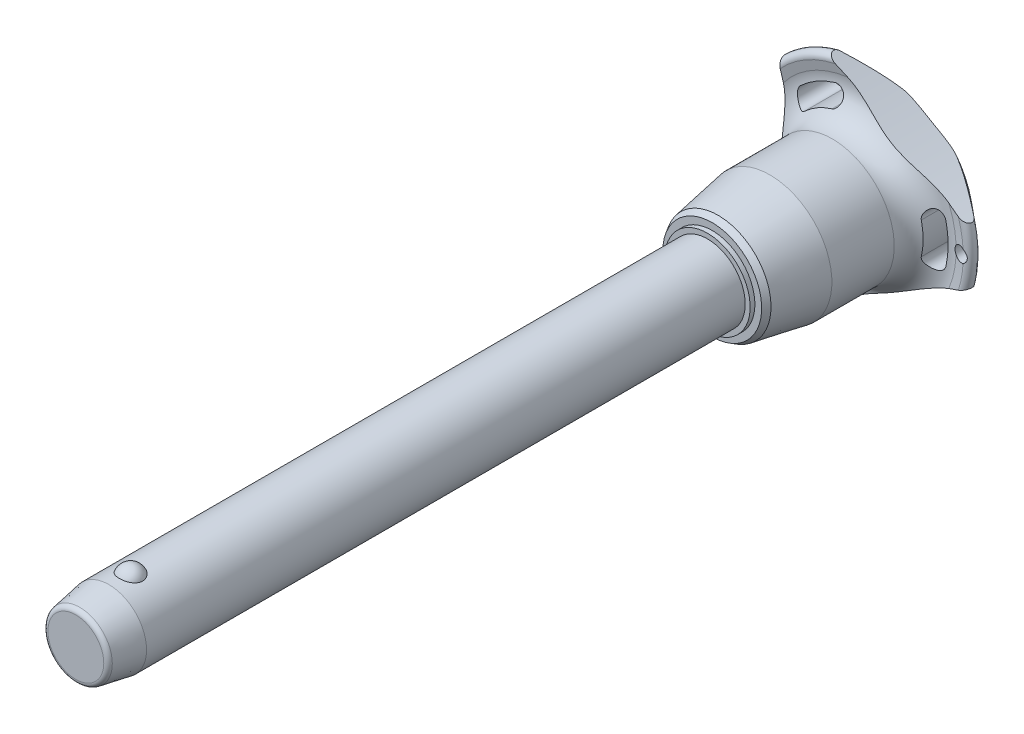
from build123d import *

# Parameters (mm, degrees)
SKETCH1_R           = 8
BOSS_EXTRUDE1_DEPTH = 120
SKETCH2_R           = 7
BOSS_EXTRUDE2_DEPTH = 39.7
BOSS_EXTRUDE3_START = 14
SKETCH1_2_R         = 8
BOSS_EXTRUDE3_DEPTH = 14
CHAMFER1_SIZE       = 7
CHAMFER1_SIZE2      = 1.234288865
FILLET1_R           = 1
SKETCH6_R           = 144.275
CUT_EXTRUDE1_DEPTH  = 164.211281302
CIRPATTERN1_COUNT   = 3
SKETCH7_R           = 1.5
CUT_EXTRUDE2_DEPTH  = 164.088271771


with BuildPart() as part:
    # Sketch1 → Boss-Extrude1 (new body)
    with BuildSketch(Plane.XY):
        Circle(SKETCH1_R)
    extrude(amount=-BOSS_EXTRUDE1_DEPTH)

    # Sketch2 → Boss-Extrude2 (add)
    with BuildSketch(Plane(origin=(0, 0, -120), x_dir=(-1, 0, 0), z_dir=(0, 0, -1))):
        Circle(SKETCH2_R)
    extrude(amount=BOSS_EXTRUDE2_DEPTH)

    # Sketch3 → Revolve1 (revolve)
    with BuildSketch(Plane(origin=(0, 0, 0), x_dir=(0, 0, -1), z_dir=(1, 0, 0))):
        with BuildLine():
            Line((-2.387467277, 9.5), (-2.387467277, 4.2))
            ThreePointArc((-2.387467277, 4.2), (0.262532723, 6.85), (-2.387467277, 9.5))
        make_face()
        with BuildLine():
            Line((-2.387467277, -4.2), (-2.387467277, -9.5))
            ThreePointArc((-2.387467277, -9.5), (0.262532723, -6.85), (-2.387467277, -4.2))
        make_face()
    revolve(axis=Axis((0, -4.2, 2.387467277), (0, 1, 0)))

    # Sketch1_2 → Boss-Extrude3 (add)
    with BuildSketch(Plane.XY.offset(BOSS_EXTRUDE3_START)):
        Circle(SKETCH1_2_R)
    extrude(amount=-BOSS_EXTRUDE3_DEPTH)

    # Chamfer1
    chamfer1_edges = [part.edges().sort_by_distance(p)[0] for p in [
        (-8, 0, 14),
    ]]
    chamfer1_side = [part.faces().sort_by_distance(p)[0] for p in [
        (-8, 0, -53),
    ]]
    chamfer(chamfer1_edges, length=CHAMFER1_SIZE, length2=CHAMFER1_SIZE2, reference=chamfer1_side[0])

    # Fillet1
    fillet1_edges = [part.edges().sort_by_distance(p)[0] for p in [
        (-6.765711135, 0, 14),
        (7, 0, -159.7),
    ]]
    fillet(fillet1_edges, radius=FILLET1_R)

    # Sketch4 → Revolve2 (revolve)
    with BuildSketch(Plane(origin=(0, 0, 0), x_dir=(0, 0, -1), z_dir=(1, 0, 0)), mode=Mode.PRIVATE) as revolve2_sk:
        Polygon((120, 0), (120, 9.044607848), (121, 9.044607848), (121, 10.490707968), (122.25235944, 11.213758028), (133.233333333, 13.15), (146.466666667, 13.15), (146.466666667, 0), align=None)
    revolve(revolve2_sk.sketch.rotate(Axis((0, 0, -146.466666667), (0, 0, 1)), 90), axis=Axis((0, 0, -146.466666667), (0, 0, 1)))

    # Sketch5 → Revolve3 (revolve)
    with BuildSketch(Plane(origin=(0, 0, 0), x_dir=(0, 0, -1), z_dir=(1, 0, 0)), mode=Mode.PRIVATE) as revolve3_sk:
        with BuildLine():
            Line((152.32877039, 20.428960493), (151.910912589, 22.344207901))
            ThreePointArc((151.910912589, 22.344207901), (152.554394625, 23.677136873), (154.002586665, 23.371345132))
            Line((154.002586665, 23.371345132), (159.141488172, 17.247040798))
            ThreePointArc((159.141488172, 17.247040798), (159.7, 15.584758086), (158.978803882, 13.986322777))
            ThreePointArc((158.978803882, 13.986322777), (154.617427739, 7.589034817), (153.083333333, 0))
            Line((153.083333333, 0), (146.466666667, 0))
            Line((146.466666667, 0), (146.466666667, 13.15))
            ThreePointArc((146.466666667, 13.15), (151.139661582, 15.38660811), (152.32877039, 20.428960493))
        make_face()
    revolve(revolve3_sk.sketch.rotate(Axis((0, 0, -153.083333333), (0, 0, 1)), 90), axis=Axis((0, 0, -153.083333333), (0, 0, 1)))

    # Sketch6 → Cut-Extrude1 (cut, through all)
    with BuildSketch(Plane.XY):
        with Locations((-159.975, 0)):
            Circle(SKETCH6_R)
        with BuildLine():
            ThreePointArc((18.131206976, -4.190753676), (18.60922037, 0), (18.131206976, 4.190753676))
            ThreePointArc((18.131206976, 4.190753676), (15.94840906, 5.553949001), (14.585213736, 3.371151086))
            ThreePointArc((14.585213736, 3.371151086), (14.969740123, 0), (14.585213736, -3.371151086))
            ThreePointArc((14.585213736, -3.371151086), (15.94840906, -5.553949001), (18.131206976, -4.190753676))
        make_face()
    cut_extrude1 = extrude(amount=-CUT_EXTRUDE1_DEPTH, mode=Mode.SUBTRACT)

    # CirPattern1: Cut-Extrude1 ×3 about axis
    cirpattern1_axis = Axis((0, 0, 0), (0, 0, 1))
    for i in range(1, CIRPATTERN1_COUNT):
        add(cut_extrude1.rotate(cirpattern1_axis, i * 360 / CIRPATTERN1_COUNT), mode=Mode.SUBTRACT)

    # Sketch7 → Cut-Extrude2 (cut, through all)
    with BuildSketch(Plane.XY):
        with Locations(Location((21.60922037, 0, 0), (0, 0, 297.620773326))):
            Circle(SKETCH7_R)
    extrude(amount=-CUT_EXTRUDE2_DEPTH, mode=Mode.SUBTRACT)


solid = part.part
